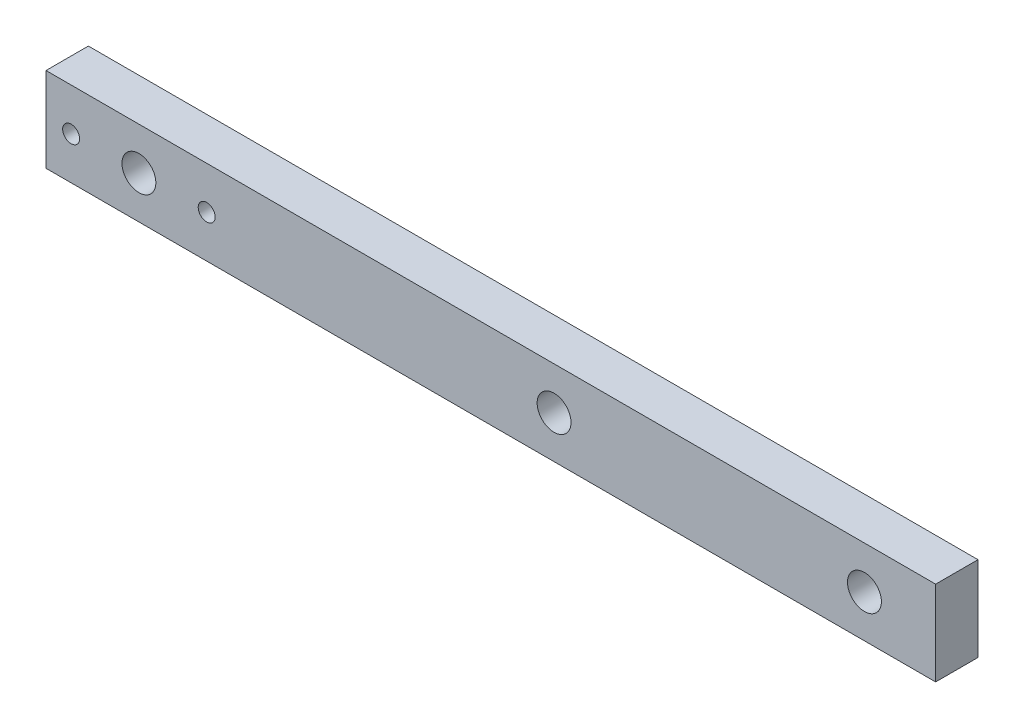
from build123d import *

# Parameters (mm, degrees)
SKETCH1_W           = 105
SKETCH1_H           = 10
BOSS_EXTRUDE1_DEPTH = 5
SKETCH2_R           = 2
SKETCH2_R_2         = 1
CUT_EXTRUDE1_DEPTH  = 5


with BuildPart() as part:
    # Sketch1 → Boss-Extrude1 (new body)
    with BuildSketch(Plane.XY):
        with Locations((-2.5, 0)):
            Rectangle(SKETCH1_W, SKETCH1_H)
    extrude(amount=BOSS_EXTRUDE1_DEPTH)

    # Sketch2 → Cut-Extrude1 (cut)
    with BuildSketch(Plane.XY.offset(5)):
        with Locations((-44.0343, 0)):
            Circle(SKETCH2_R)
        with Locations((-52.0343, 0)):
            Circle(SKETCH2_R_2)
        with Locations((-36.0343, 0)):
            Circle(SKETCH2_R_2)
        with Locations((41.598396, 0)):
            Circle(SKETCH2_R)
        with Locations((4.9657, 0)):
            Circle(SKETCH2_R)
    extrude(amount=-CUT_EXTRUDE1_DEPTH, mode=Mode.SUBTRACT)


solid = part.part
